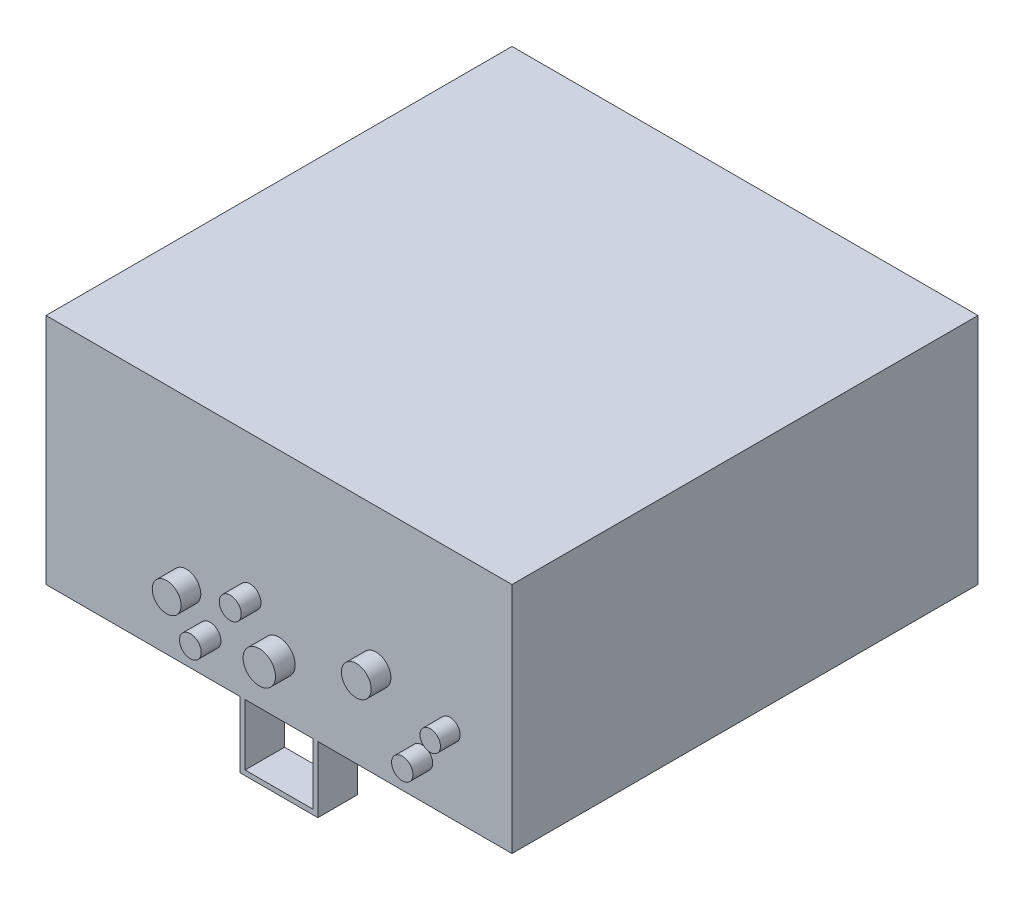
from build123d import *

# Parameters (mm, degrees)
BOSS_EXTRUDE1_DEPTH = 300
BOSS_EXTRUDE2_DEPTH = 50.8
SKETCH3_R           = 18.553371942
SKETCH3_R_2         = 20.850730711
SKETCH3_R_3         = 19.185129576
SKETCH3_R_4         = 13.763380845
SKETCH3_R_5         = 13.213937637
SKETCH3_R_6         = 14.151938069
SKETCH3_R_7         = 13.993998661
BOSS_EXTRUDE3_DEPTH = 25.4


with BuildPart() as part:
    # Sketch1 → Boss-Extrude1 (new body)
    with BuildSketch(Plane(origin=(0, 0, 0), x_dir=(1, 0, 0), z_dir=(0, 1, 0))):
        Polygon((-299.999999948, 299.999999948), (299.999999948, 299.999999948), (-299.999999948, -299.999999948), align=None)
        Polygon((-299.999999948, -299.999999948), (299.999999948, -299.999999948), (299.999999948, 299.999999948), align=None)
    extrude(amount=BOSS_EXTRUDE1_DEPTH)

    # Sketch2 → Boss-Extrude2 (add)
    with BuildSketch(Plane.XY.offset(299.999999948)):
        Polygon((-49.999999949, 0), (-49.999999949, -85), (49.999999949, -85), (49.999999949, 0), (43.649999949, 0), (43.649999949, -78.65), (-43.649999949, -78.65), (-43.649999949, 0), align=None)
    boss_extrude2 = extrude(amount=-BOSS_EXTRUDE2_DEPTH)

    # Mirror1: Boss-Extrude2 across plane
    add(boss_extrude2.mirror(Plane.XY))

    # Sketch3 → Boss-Extrude3 (add)
    with BuildSketch(Plane.XY.offset(299.999999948)):
        with Locations(Location((-119.268064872, 88.998202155, 0), (0, 0, 180))):
            Circle(SKETCH3_R)
        with Locations(Location((0, 70.444830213, 0), (0, 0, 180))):
            Circle(SKETCH3_R_2)
        with Locations(Location((124.926619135, 117.996386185, 0), (0, 0, 180))):
            Circle(SKETCH3_R_3)
        with Locations(Location((184.082271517, 49.594099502, 0), (0, 0, 180))):
            Circle(SKETCH3_R_4)
        with Locations(Location((220.069526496, 98.811256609, 0), (0, 0, 180))):
            Circle(SKETCH3_R_5)
        with Locations(Location((-37.35728522, 117.996386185, 0), (0, 0, 180))):
            Circle(SKETCH3_R_6)
        with Locations(Location((-88.739123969, 49.594099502, 0), (0, 0, 180))):
            Circle(SKETCH3_R_7)
    extrude(amount=BOSS_EXTRUDE3_DEPTH)


solid = part.part
